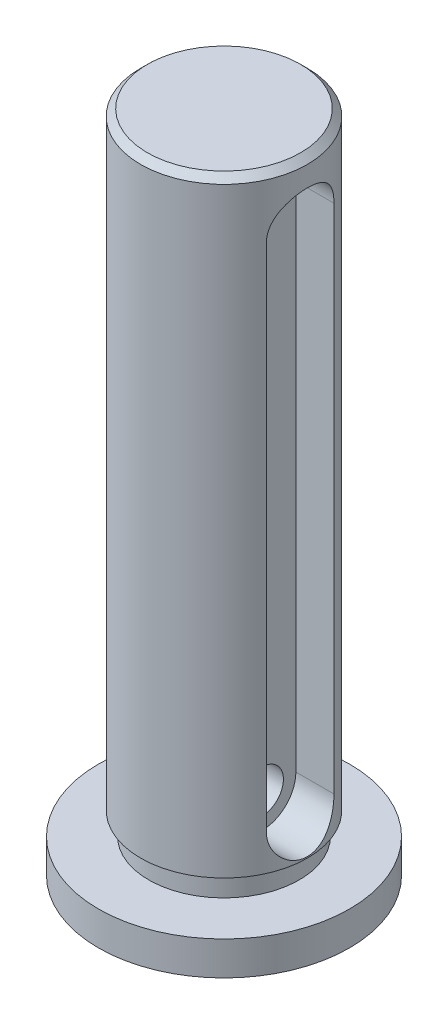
ISO-10303-21;
HEADER;
FILE_DESCRIPTION(('STEP AP214'),'2;1');
FILE_NAME('part.step','',(''),(''),'','','');
FILE_SCHEMA(('AUTOMOTIVE_DESIGN { 1 0 10303 214 1 1 1 1 }'));
ENDSEC;
DATA;
#1=APPLICATION_CONTEXT('core data for automotive mechanical design processes');
#2=APPLICATION_PROTOCOL_DEFINITION('international standard','automotive_design',2000,#1);
#3=PRODUCT_CONTEXT('',#1,'mechanical');
#4=PRODUCT('Part','Part','',(#3));
#5=PRODUCT_RELATED_PRODUCT_CATEGORY('part','',(#4));
#6=PRODUCT_DEFINITION_FORMATION('','',#4);
#7=PRODUCT_DEFINITION_CONTEXT('part definition',#1,'design');
#8=PRODUCT_DEFINITION('design','',#6,#7);
#9=PRODUCT_DEFINITION_SHAPE('','',#8);
#10=(LENGTH_UNIT() NAMED_UNIT(*) SI_UNIT(.MILLI.,.METRE.));
#11=(NAMED_UNIT(*) PLANE_ANGLE_UNIT() SI_UNIT($,.RADIAN.));
#12=(NAMED_UNIT(*) SI_UNIT($,.STERADIAN.) SOLID_ANGLE_UNIT());
#13=UNCERTAINTY_MEASURE_WITH_UNIT(LENGTH_MEASURE(1.E-05),#10,'distance_accuracy_value','');
#14=(GEOMETRIC_REPRESENTATION_CONTEXT(3) GLOBAL_UNCERTAINTY_ASSIGNED_CONTEXT((#13)) GLOBAL_UNIT_ASSIGNED_CONTEXT((#10,
#11,#12)) REPRESENTATION_CONTEXT('',''));
#15=CARTESIAN_POINT('',(0.,0.,0.));
#16=DIRECTION('',(0.,0.,1.));
#17=DIRECTION('',(1.,0.,0.));
#18=AXIS2_PLACEMENT_3D('',#15,#16,#17);
#19=CARTESIAN_POINT('',(0.,12.9032,0.));
#20=DIRECTION('',(0.,1.,0.));
#21=DIRECTION('',(-1.,0.,0.));
#22=AXIS2_PLACEMENT_3D('',#19,#20,#21);
#23=CYLINDRICAL_SURFACE('',#22,3.1369);
#24=CARTESIAN_POINT('',(0.,25.5524,0.));
#25=DIRECTION('',(0.,-1.,0.));
#26=DIRECTION('',(1.,0.,0.));
#27=AXIS2_PLACEMENT_3D('',#24,#25,#26);
#28=CIRCLE('',#27,3.1369);
#29=CARTESIAN_POINT('',(3.1369,25.5524,0.));
#30=VERTEX_POINT('',#29);
#31=EDGE_CURVE('E11',#30,#30,#28,.T.);
#32=ORIENTED_EDGE('',*,*,#31,.T.);
#33=EDGE_LOOP('',(#32));
#34=FACE_BOUND('',#33,.T.);
#35=CARTESIAN_POINT('',(0.,2.9464,0.));
#36=DIRECTION('',(0.,1.,0.));
#37=DIRECTION('',(-1.,0.,0.));
#38=AXIS2_PLACEMENT_3D('',#35,#36,#37);
#39=CIRCLE('',#38,3.1369);
#40=CARTESIAN_POINT('',(-3.1369,2.9464,0.));
#41=VERTEX_POINT('',#40);
#42=EDGE_CURVE('E82',#41,#41,#39,.T.);
#43=ORIENTED_EDGE('',*,*,#42,.T.);
#44=EDGE_LOOP('',(#43));
#45=FACE_BOUND('',#44,.T.);
#46=CARTESIAN_POINT('',(2.86831686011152,23.5204,-1.27));
#47=CARTESIAN_POINT('',(2.86831228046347,23.5545372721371,-1.2700015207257));
#48=CARTESIAN_POINT('',(2.86892705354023,23.5886564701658,-1.26862270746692));
#49=CARTESIAN_POINT('',(2.87134964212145,23.6566187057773,-1.26313358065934));
#50=CARTESIAN_POINT('',(2.87315699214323,23.6904618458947,-1.25902433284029));
#51=CARTESIAN_POINT('',(2.88027699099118,23.790929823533,-1.24269627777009));
#52=CARTESIAN_POINT('',(2.88728848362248,23.8568304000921,-1.22647648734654));
#53=CARTESIAN_POINT('',(2.90495322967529,23.9846552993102,-1.1840218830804));
#54=CARTESIAN_POINT('',(2.91560254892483,24.0465838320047,-1.15779788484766));
#55=CARTESIAN_POINT('',(2.93933152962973,24.1652356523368,-1.09615716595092));
#56=CARTESIAN_POINT('',(2.95241356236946,24.2219537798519,-1.06073146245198));
#57=CARTESIAN_POINT('',(2.98037578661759,24.3318005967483,-0.979509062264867));
#58=CARTESIAN_POINT('',(2.99531437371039,24.3845833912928,-0.933264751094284));
#59=CARTESIAN_POINT('',(3.02482364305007,24.4818932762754,-0.832664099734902));
#60=CARTESIAN_POINT('',(3.03939424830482,24.5264186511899,-0.778306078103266));
#61=CARTESIAN_POINT('',(3.06723971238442,24.6077075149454,-0.660302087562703));
#62=CARTESIAN_POINT('',(3.08043785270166,24.644082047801,-0.596368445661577));
#63=CARTESIAN_POINT('',(3.10333328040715,24.7054100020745,-0.462659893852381));
#64=CARTESIAN_POINT('',(3.11303206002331,24.7303682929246,-0.392887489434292));
#65=CARTESIAN_POINT('',(3.12741857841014,24.7669044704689,-0.253142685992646));
#66=CARTESIAN_POINT('',(3.13233046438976,24.7790831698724,-0.183350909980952));
#67=CARTESIAN_POINT('',(3.13740114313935,24.7916512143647,-0.0425517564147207));
#68=CARTESIAN_POINT('',(3.13756166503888,24.7920448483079,0.028455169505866));
#69=CARTESIAN_POINT('',(3.13324642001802,24.7813562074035,0.165317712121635));
#70=CARTESIAN_POINT('',(3.12903679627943,24.7709327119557,0.231234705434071));
#71=CARTESIAN_POINT('',(3.11681505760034,24.7400290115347,0.360289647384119));
#72=CARTESIAN_POINT('',(3.10880272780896,24.7195482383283,0.423427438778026));
#73=CARTESIAN_POINT('',(3.0896034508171,24.6688617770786,0.546277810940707));
#74=CARTESIAN_POINT('',(3.07837026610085,24.6385135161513,0.60592404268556));
#75=CARTESIAN_POINT('',(3.05383948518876,24.5690882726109,0.719432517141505));
#76=CARTESIAN_POINT('',(3.04054115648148,24.5300081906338,0.77329269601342));
#77=CARTESIAN_POINT('',(3.0121738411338,24.441180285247,0.877531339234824));
#78=CARTESIAN_POINT('',(2.99704591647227,24.3908932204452,0.927434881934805));
#79=CARTESIAN_POINT('',(2.96740404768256,24.2826029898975,1.01830484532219));
#80=CARTESIAN_POINT('',(2.95289039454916,24.2245962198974,1.05926706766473));
#81=CARTESIAN_POINT('',(2.92570847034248,24.1003226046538,1.13222635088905));
#82=CARTESIAN_POINT('',(2.91310878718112,24.0338598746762,1.16391690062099));
#83=CARTESIAN_POINT('',(2.89199846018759,23.8959304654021,1.21543096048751));
#84=CARTESIAN_POINT('',(2.883480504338,23.8244729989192,1.23527570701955));
#85=CARTESIAN_POINT('',(2.87456629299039,23.7136344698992,1.25581250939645));
#86=CARTESIAN_POINT('',(2.87223406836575,23.6752113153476,1.26112514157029));
#87=CARTESIAN_POINT('',(2.86910563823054,23.598000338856,1.26821960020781));
#88=CARTESIAN_POINT('',(2.86830859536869,23.5592127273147,1.27000335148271));
#89=CARTESIAN_POINT('',(2.86831686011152,23.5204,1.27));
#90=B_SPLINE_CURVE_WITH_KNOTS('',3,(#46,#47,#48,#49,#50,#51,#52,#53,#54,#55,#56,#57,#58,#59,#60,
#61,#62,#63,#64,#65,#66,#67,#68,#69,#70,#71,#72,#73,#74,#75,#76,#77,#78,#79,#80,#81,#82,#83,#84,
#85,#86,#87,#88,#89),.UNSPECIFIED.,.F.,.F.,(4,2,2,2,2,2,2,2,2,2,2,2,2,2,2,2,2,2,2,2,2,4),(0.,
0.102343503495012,0.204647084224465,0.408256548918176,0.611646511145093,0.815235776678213,
1.02953735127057,1.24388339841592,1.46693998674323,1.68990134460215,1.90183353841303,
2.11368860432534,2.31335799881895,2.51303867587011,2.71574322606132,2.91851984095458,
3.1348799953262,3.35134152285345,3.57430997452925,3.7968774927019,3.91328211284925,
4.02962322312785),.UNSPECIFIED.);
#91=CARTESIAN_POINT('',(2.86831686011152,23.5204,-1.27));
#92=VERTEX_POINT('',#91);
#93=CARTESIAN_POINT('',(2.86831686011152,23.5204,1.27));
#94=VERTEX_POINT('',#93);
#95=EDGE_CURVE('E57',#92,#94,#90,.T.);
#96=ORIENTED_EDGE('',*,*,#95,.F.);
#97=DIRECTION('',(0.,1.,0.));
#98=VECTOR('',#97,1.);
#99=CARTESIAN_POINT('',(2.86831686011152,12.9032,-1.27));
#100=LINE('',#99,#98);
#101=CARTESIAN_POINT('',(2.86831686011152,4.26720000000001,-1.27));
#102=VERTEX_POINT('',#101);
#103=EDGE_CURVE('E123',#102,#92,#100,.T.);
#104=ORIENTED_EDGE('',*,*,#103,.F.);
#105=CARTESIAN_POINT('',(2.86831686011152,4.26720000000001,1.27));
#106=CARTESIAN_POINT('',(2.86831228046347,4.23306272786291,1.27000152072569));
#107=CARTESIAN_POINT('',(2.86892705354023,4.19894352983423,1.26862270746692));
#108=CARTESIAN_POINT('',(2.87134964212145,4.13098129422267,1.26313358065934));
#109=CARTESIAN_POINT('',(2.87315699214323,4.0971381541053,1.25902433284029));
#110=CARTESIAN_POINT('',(2.88027699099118,3.996670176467,1.24269627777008));
#111=CARTESIAN_POINT('',(2.88728848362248,3.93076959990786,1.22647648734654));
#112=CARTESIAN_POINT('',(2.90495322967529,3.80294470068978,1.1840218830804));
#113=CARTESIAN_POINT('',(2.91560254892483,3.74101616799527,1.15779788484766));
#114=CARTESIAN_POINT('',(2.93933152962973,3.6223643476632,1.09615716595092));
#115=CARTESIAN_POINT('',(2.95241356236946,3.56564622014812,1.06073146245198));
#116=CARTESIAN_POINT('',(2.98037578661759,3.4557994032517,0.979509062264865));
#117=CARTESIAN_POINT('',(2.99531437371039,3.40301660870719,0.933264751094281));
#118=CARTESIAN_POINT('',(3.02482364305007,3.30570672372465,0.8326640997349));
#119=CARTESIAN_POINT('',(3.03939424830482,3.26118134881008,0.778306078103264));
#120=CARTESIAN_POINT('',(3.06723971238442,3.17989248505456,0.660302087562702));
#121=CARTESIAN_POINT('',(3.08043785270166,3.14351795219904,0.596368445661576));
#122=CARTESIAN_POINT('',(3.10333328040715,3.08218999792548,0.462659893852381));
#123=CARTESIAN_POINT('',(3.11303206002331,3.05723170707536,0.392887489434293));
#124=CARTESIAN_POINT('',(3.12741857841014,3.02069552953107,0.253142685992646));
#125=CARTESIAN_POINT('',(3.13233046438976,3.00851683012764,0.183350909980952));
#126=CARTESIAN_POINT('',(3.13740114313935,2.99594878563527,0.04255175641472));
#127=CARTESIAN_POINT('',(3.13756166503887,2.99555515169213,-0.0284551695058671));
#128=CARTESIAN_POINT('',(3.13324642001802,3.00624379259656,-0.165317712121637));
#129=CARTESIAN_POINT('',(3.12903679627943,3.01666728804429,-0.231234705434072));
#130=CARTESIAN_POINT('',(3.11681505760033,3.04757098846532,-0.360289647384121));
#131=CARTESIAN_POINT('',(3.10880272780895,3.06805176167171,-0.423427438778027));
#132=CARTESIAN_POINT('',(3.0896034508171,3.11873822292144,-0.546277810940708));
#133=CARTESIAN_POINT('',(3.07837026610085,3.14908648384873,-0.605924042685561));
#134=CARTESIAN_POINT('',(3.05383948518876,3.21851172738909,-0.719432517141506));
#135=CARTESIAN_POINT('',(3.04054115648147,3.25759180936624,-0.773292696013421));
#136=CARTESIAN_POINT('',(3.0121738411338,3.34641971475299,-0.877531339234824));
#137=CARTESIAN_POINT('',(2.99704591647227,3.39670677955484,-0.927434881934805));
#138=CARTESIAN_POINT('',(2.96740404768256,3.50499701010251,-1.01830484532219));
#139=CARTESIAN_POINT('',(2.95289039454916,3.56300378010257,-1.05926706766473));
#140=CARTESIAN_POINT('',(2.92570847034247,3.68727739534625,-1.13222635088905));
#141=CARTESIAN_POINT('',(2.91310878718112,3.75374012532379,-1.16391690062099));
#142=CARTESIAN_POINT('',(2.89199846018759,3.89166953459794,-1.21543096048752));
#143=CARTESIAN_POINT('',(2.883480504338,3.96312700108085,-1.23527570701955));
#144=CARTESIAN_POINT('',(2.87456629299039,4.07396553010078,-1.25581250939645));
#145=CARTESIAN_POINT('',(2.87223406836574,4.11238868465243,-1.2611251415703));
#146=CARTESIAN_POINT('',(2.86910563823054,4.18959966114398,-1.26821960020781));
#147=CARTESIAN_POINT('',(2.86830859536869,4.2283872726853,-1.27000335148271));
#148=CARTESIAN_POINT('',(2.86831686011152,4.26720000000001,-1.27));
#149=B_SPLINE_CURVE_WITH_KNOTS('',3,(#105,#106,#107,#108,#109,#110,#111,#112,#113,#114,#115,
#116,#117,#118,#119,#120,#121,#122,#123,#124,#125,#126,#127,#128,#129,#130,#131,#132,#133,#134,
#135,#136,#137,#138,#139,#140,#141,#142,#143,#144,#145,#146,#147,#148),.UNSPECIFIED.,.F.,.F.,(4,
2,2,2,2,2,2,2,2,2,2,2,2,2,2,2,2,2,2,2,2,4),(0.,0.102343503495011,0.20464708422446,
0.408256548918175,0.611646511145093,0.81523577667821,1.02953735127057,1.24388339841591,
1.46693998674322,1.68990134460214,1.90183353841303,2.11368860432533,2.31335799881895,
2.5130386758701,2.71574322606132,2.91851984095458,3.13487999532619,3.35134152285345,
3.57430997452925,3.7968774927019,3.91328211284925,4.02962322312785),.UNSPECIFIED.);
#150=CARTESIAN_POINT('',(2.86831686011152,4.26720000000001,1.27));
#151=VERTEX_POINT('',#150);
#152=EDGE_CURVE('E125',#151,#102,#149,.T.);
#153=ORIENTED_EDGE('',*,*,#152,.F.);
#154=DIRECTION('',(0.,1.,0.));
#155=VECTOR('',#154,1.);
#156=CARTESIAN_POINT('',(2.86831686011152,12.9032,1.27));
#157=LINE('',#156,#155);
#158=EDGE_CURVE('E133',#94,#151,#157,.F.);
#159=ORIENTED_EDGE('',*,*,#158,.F.);
#160=EDGE_LOOP('',(#96,#104,#153,#159));
#161=FACE_BOUND('',#160,.T.);
#162=ADVANCED_FACE('F34',(#34,#45,#161),#23,.T.);
#163=CARTESIAN_POINT('',(0.,14.1366875,0.));
#164=DIRECTION('',(0.,1.,0.));
#165=DIRECTION('',(1.,0.,0.));
#166=AXIS2_PLACEMENT_3D('',#163,#164,#165);
#167=SPHERICAL_SURFACE('',#166,14.1366875);
#168=CARTESIAN_POINT('',(0.,0.812800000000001,0.));
#169=DIRECTION('',(0.,1.,0.));
#170=DIRECTION('',(-1.,0.,0.));
#171=AXIS2_PLACEMENT_3D('',#168,#169,#170);
#172=CIRCLE('',#171,4.7244);
#173=CARTESIAN_POINT('',(-4.7244,0.812800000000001,0.));
#174=VERTEX_POINT('',#173);
#175=EDGE_CURVE('E120',#174,#174,#172,.T.);
#176=ORIENTED_EDGE('',*,*,#175,.F.);
#177=EDGE_LOOP('',(#176));
#178=FACE_BOUND('',#177,.T.);
#179=ADVANCED_FACE('F170',(#178),#167,.T.);
#180=CARTESIAN_POINT('',(0.,12.9032,0.));
#181=DIRECTION('',(0.,1.,0.));
#182=DIRECTION('',(-1.,0.,0.));
#183=AXIS2_PLACEMENT_3D('',#180,#181,#182);
#184=CYLINDRICAL_SURFACE('',#183,4.7244);
#185=CARTESIAN_POINT('',(0.,2.0828,0.));
#186=DIRECTION('',(0.,1.,0.));
#187=DIRECTION('',(-1.,0.,0.));
#188=AXIS2_PLACEMENT_3D('',#185,#186,#187);
#189=CIRCLE('',#188,4.7244);
#190=CARTESIAN_POINT('',(-4.7244,2.0828,0.));
#191=VERTEX_POINT('',#190);
#192=EDGE_CURVE('E117',#191,#191,#189,.T.);
#193=ORIENTED_EDGE('',*,*,#192,.F.);
#194=EDGE_LOOP('',(#193));
#195=FACE_BOUND('',#194,.T.);
#196=ORIENTED_EDGE('',*,*,#175,.T.);
#197=EDGE_LOOP('',(#196));
#198=FACE_BOUND('',#197,.T.);
#199=ADVANCED_FACE('F175',(#195,#198),#184,.T.);
#200=CARTESIAN_POINT('',(4.7244,2.0828,0.));
#201=DIRECTION('',(0.,-1.,0.));
#202=DIRECTION('',(1.,0.,0.));
#203=AXIS2_PLACEMENT_3D('',#200,#201,#202);
#204=PLANE('',#203);
#205=CARTESIAN_POINT('',(0.,2.0828,0.));
#206=DIRECTION('',(0.,1.,0.));
#207=DIRECTION('',(-1.,0.,0.));
#208=AXIS2_PLACEMENT_3D('',#205,#206,#207);
#209=CIRCLE('',#208,2.8321);
#210=CARTESIAN_POINT('',(-2.8321,2.0828,0.));
#211=VERTEX_POINT('',#210);
#212=EDGE_CURVE('E114',#211,#211,#209,.T.);
#213=ORIENTED_EDGE('',*,*,#212,.F.);
#214=EDGE_LOOP('',(#213));
#215=FACE_BOUND('',#214,.T.);
#216=ORIENTED_EDGE('',*,*,#192,.T.);
#217=EDGE_LOOP('',(#216));
#218=FACE_BOUND('',#217,.T.);
#219=ADVANCED_FACE('F293',(#215,#218),#204,.F.);
#220=CARTESIAN_POINT('',(0.,12.9032,0.));
#221=DIRECTION('',(0.,1.,0.));
#222=DIRECTION('',(-1.,0.,0.));
#223=AXIS2_PLACEMENT_3D('',#220,#221,#222);
#224=CYLINDRICAL_SURFACE('',#223,2.8321);
#225=CARTESIAN_POINT('',(0.,2.9464,0.));
#226=DIRECTION('',(0.,1.,0.));
#227=DIRECTION('',(-1.,0.,0.));
#228=AXIS2_PLACEMENT_3D('',#225,#226,#227);
#229=CIRCLE('',#228,2.8321);
#230=CARTESIAN_POINT('',(-2.8321,2.9464,0.));
#231=VERTEX_POINT('',#230);
#232=EDGE_CURVE('E111',#231,#231,#229,.T.);
#233=ORIENTED_EDGE('',*,*,#232,.F.);
#234=EDGE_LOOP('',(#233));
#235=FACE_BOUND('',#234,.T.);
#236=ORIENTED_EDGE('',*,*,#212,.T.);
#237=EDGE_LOOP('',(#236));
#238=FACE_BOUND('',#237,.T.);
#239=ADVANCED_FACE('F286',(#235,#238),#224,.T.);
#240=CARTESIAN_POINT('',(2.8321,2.9464,0.));
#241=DIRECTION('',(0.,1.,0.));
#242=DIRECTION('',(-1.,0.,0.));
#243=AXIS2_PLACEMENT_3D('',#240,#241,#242);
#244=PLANE('',#243);
#245=ORIENTED_EDGE('',*,*,#42,.F.);
#246=EDGE_LOOP('',(#245));
#247=FACE_BOUND('',#246,.T.);
#248=ORIENTED_EDGE('',*,*,#232,.T.);
#249=EDGE_LOOP('',(#248));
#250=FACE_BOUND('',#249,.T.);
#251=ADVANCED_FACE('F235',(#247,#250),#244,.F.);
#252=CARTESIAN_POINT('',(3.1369,25.8064,0.));
#253=DIRECTION('',(0.,-1.,0.));
#254=DIRECTION('',(1.,0.,0.));
#255=AXIS2_PLACEMENT_3D('',#252,#253,#254);
#256=PLANE('',#255);
#257=CARTESIAN_POINT('',(0.,25.8064,0.));
#258=DIRECTION('',(0.,-1.,0.));
#259=DIRECTION('',(1.,0.,0.));
#260=AXIS2_PLACEMENT_3D('',#257,#258,#259);
#261=CIRCLE('',#260,2.88290000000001);
#262=CARTESIAN_POINT('',(2.88290000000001,25.8064,0.));
#263=VERTEX_POINT('',#262);
#264=EDGE_CURVE('E42',#263,#263,#261,.F.);
#265=ORIENTED_EDGE('',*,*,#264,.T.);
#266=EDGE_LOOP('',(#265));
#267=FACE_BOUND('',#266,.T.);
#268=ADVANCED_FACE('F150',(#267),#256,.F.);
#269=CARTESIAN_POINT('',(3.8481,23.5204,0.));
#270=DIRECTION('',(-1.,0.,0.));
#271=DIRECTION('',(0.,0.,1.));
#272=AXIS2_PLACEMENT_3D('',#269,#270,#271);
#273=CYLINDRICAL_SURFACE('',#272,1.27);
#274=ORIENTED_EDGE('',*,*,#95,.T.);
#275=DIRECTION('',(-1.,0.,0.));
#276=VECTOR('',#275,1.);
#277=CARTESIAN_POINT('',(3.8481,23.5204,1.27));
#278=LINE('',#277,#276);
#279=CARTESIAN_POINT('',(1.4351,23.5204,1.27));
#280=VERTEX_POINT('',#279);
#281=EDGE_CURVE('E74',#94,#280,#278,.T.);
#282=ORIENTED_EDGE('',*,*,#281,.T.);
#283=CARTESIAN_POINT('',(1.4351,23.5204,0.));
#284=DIRECTION('',(1.,0.,0.));
#285=DIRECTION('',(0.,0.,-1.));
#286=AXIS2_PLACEMENT_3D('',#283,#284,#285);
#287=CIRCLE('',#286,1.27);
#288=CARTESIAN_POINT('',(1.4351,23.5204,-1.27));
#289=VERTEX_POINT('',#288);
#290=EDGE_CURVE('E78',#289,#280,#287,.T.);
#291=ORIENTED_EDGE('',*,*,#290,.F.);
#292=DIRECTION('',(-1.,0.,0.));
#293=VECTOR('',#292,1.);
#294=CARTESIAN_POINT('',(3.8481,23.5204,-1.27));
#295=LINE('',#294,#293);
#296=EDGE_CURVE('E105',#92,#289,#295,.T.);
#297=ORIENTED_EDGE('',*,*,#296,.F.);
#298=EDGE_LOOP('',(#274,#282,#291,#297));
#299=FACE_BOUND('',#298,.T.);
#300=ADVANCED_FACE('F76',(#299),#273,.F.);
#301=CARTESIAN_POINT('',(3.8481,23.5204,1.27));
#302=DIRECTION('',(0.,0.,-1.));
#303=DIRECTION('',(0.,1.,0.));
#304=AXIS2_PLACEMENT_3D('',#301,#302,#303);
#305=PLANE('',#304);
#306=ORIENTED_EDGE('',*,*,#158,.T.);
#307=DIRECTION('',(-1.,0.,0.));
#308=VECTOR('',#307,1.);
#309=CARTESIAN_POINT('',(3.8481,4.26720000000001,1.27));
#310=LINE('',#309,#308);
#311=CARTESIAN_POINT('',(1.4351,4.26720000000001,1.27));
#312=VERTEX_POINT('',#311);
#313=EDGE_CURVE('E83',#151,#312,#310,.T.);
#314=ORIENTED_EDGE('',*,*,#313,.T.);
#315=DIRECTION('',(0.,-1.,0.));
#316=VECTOR('',#315,1.);
#317=CARTESIAN_POINT('',(1.4351,23.5204,1.27));
#318=LINE('',#317,#316);
#319=EDGE_CURVE('E86',#280,#312,#318,.T.);
#320=ORIENTED_EDGE('',*,*,#319,.F.);
#321=ORIENTED_EDGE('',*,*,#281,.F.);
#322=EDGE_LOOP('',(#306,#314,#320,#321));
#323=FACE_BOUND('',#322,.T.);
#324=ADVANCED_FACE('F87',(#323),#305,.T.);
#325=CARTESIAN_POINT('',(3.8481,4.26720000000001,0.));
#326=DIRECTION('',(-1.,0.,0.));
#327=DIRECTION('',(0.,0.,1.));
#328=AXIS2_PLACEMENT_3D('',#325,#326,#327);
#329=CYLINDRICAL_SURFACE('',#328,1.27);
#330=ORIENTED_EDGE('',*,*,#152,.T.);
#331=DIRECTION('',(-1.,0.,0.));
#332=VECTOR('',#331,1.);
#333=CARTESIAN_POINT('',(3.8481,4.26720000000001,-1.27));
#334=LINE('',#333,#332);
#335=CARTESIAN_POINT('',(1.4351,4.26720000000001,-1.27));
#336=VERTEX_POINT('',#335);
#337=EDGE_CURVE('E49',#102,#336,#334,.T.);
#338=ORIENTED_EDGE('',*,*,#337,.T.);
#339=CARTESIAN_POINT('',(1.4351,4.26720000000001,0.));
#340=DIRECTION('',(1.,0.,0.));
#341=DIRECTION('',(0.,0.,-1.));
#342=AXIS2_PLACEMENT_3D('',#339,#340,#341);
#343=CIRCLE('',#342,1.27);
#344=EDGE_CURVE('E92',#312,#336,#343,.T.);
#345=ORIENTED_EDGE('',*,*,#344,.F.);
#346=ORIENTED_EDGE('',*,*,#313,.F.);
#347=EDGE_LOOP('',(#330,#338,#345,#346));
#348=FACE_BOUND('',#347,.T.);
#349=ADVANCED_FACE('F138',(#348),#329,.F.);
#350=CARTESIAN_POINT('',(3.8481,23.5204,-1.27));
#351=DIRECTION('',(0.,0.,1.));
#352=DIRECTION('',(0.,-1.,0.));
#353=AXIS2_PLACEMENT_3D('',#350,#351,#352);
#354=PLANE('',#353);
#355=ORIENTED_EDGE('',*,*,#103,.T.);
#356=ORIENTED_EDGE('',*,*,#296,.T.);
#357=DIRECTION('',(0.,1.,0.));
#358=VECTOR('',#357,1.);
#359=CARTESIAN_POINT('',(1.4351,23.5204,-1.27));
#360=LINE('',#359,#358);
#361=EDGE_CURVE('E95',#336,#289,#360,.T.);
#362=ORIENTED_EDGE('',*,*,#361,.F.);
#363=ORIENTED_EDGE('',*,*,#337,.F.);
#364=EDGE_LOOP('',(#355,#356,#362,#363));
#365=FACE_BOUND('',#364,.T.);
#366=ADVANCED_FACE('F143',(#365),#354,.T.);
#367=CARTESIAN_POINT('',(1.4351,23.5204,0.));
#368=DIRECTION('',(1.,0.,0.));
#369=DIRECTION('',(0.,0.,-1.));
#370=AXIS2_PLACEMENT_3D('',#367,#368,#369);
#371=PLANE('',#370);
#372=CARTESIAN_POINT('',(1.4351,4.26720000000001,0.));
#373=DIRECTION('',(1.,0.,0.));
#374=DIRECTION('',(0.,1.,0.));
#375=AXIS2_PLACEMENT_3D('',#372,#373,#374);
#376=CIRCLE('',#375,0.8001);
#377=CARTESIAN_POINT('',(1.4351,5.06730000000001,0.));
#378=VERTEX_POINT('',#377);
#379=EDGE_CURVE('E209',#378,#378,#376,.T.);
#380=ORIENTED_EDGE('',*,*,#379,.F.);
#381=EDGE_LOOP('',(#380));
#382=FACE_BOUND('',#381,.T.);
#383=CARTESIAN_POINT('',(1.4351,23.5204,0.));
#384=DIRECTION('',(1.,0.,0.));
#385=DIRECTION('',(0.,1.,0.));
#386=AXIS2_PLACEMENT_3D('',#383,#384,#385);
#387=CIRCLE('',#386,0.800099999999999);
#388=CARTESIAN_POINT('',(1.4351,24.3205,0.));
#389=VERTEX_POINT('',#388);
#390=EDGE_CURVE('E99',#389,#389,#387,.T.);
#391=ORIENTED_EDGE('',*,*,#390,.F.);
#392=EDGE_LOOP('',(#391));
#393=FACE_BOUND('',#392,.T.);
#394=ORIENTED_EDGE('',*,*,#290,.T.);
#395=ORIENTED_EDGE('',*,*,#319,.T.);
#396=ORIENTED_EDGE('',*,*,#344,.T.);
#397=ORIENTED_EDGE('',*,*,#361,.T.);
#398=EDGE_LOOP('',(#394,#395,#396,#397));
#399=FACE_BOUND('',#398,.T.);
#400=ADVANCED_FACE('F94',(#382,#393,#399),#371,.T.);
#401=CARTESIAN_POINT('',(0.317499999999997,23.5204,0.));
#402=DIRECTION('',(1.,0.,0.));
#403=DIRECTION('',(0.,1.,0.));
#404=AXIS2_PLACEMENT_3D('',#401,#402,#403);
#405=CYLINDRICAL_SURFACE('',#404,0.800099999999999);
#406=CARTESIAN_POINT('',(0.317499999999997,23.5204,0.));
#407=DIRECTION('',(1.,0.,0.));
#408=DIRECTION('',(0.,1.,0.));
#409=AXIS2_PLACEMENT_3D('',#406,#407,#408);
#410=CIRCLE('',#409,0.800099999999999);
#411=CARTESIAN_POINT('',(0.317499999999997,24.3205,0.));
#412=VERTEX_POINT('',#411);
#413=EDGE_CURVE('E96',#412,#412,#410,.T.);
#414=ORIENTED_EDGE('',*,*,#413,.F.);
#415=EDGE_LOOP('',(#414));
#416=FACE_BOUND('',#415,.T.);
#417=ORIENTED_EDGE('',*,*,#390,.T.);
#418=EDGE_LOOP('',(#417));
#419=FACE_BOUND('',#418,.T.);
#420=ADVANCED_FACE('F186',(#416,#419),#405,.F.);
#421=CARTESIAN_POINT('',(0.317499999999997,23.5204,0.));
#422=DIRECTION('',(1.,0.,0.));
#423=DIRECTION('',(0.,1.,0.));
#424=AXIS2_PLACEMENT_3D('',#421,#422,#423);
#425=PLANE('',#424);
#426=ORIENTED_EDGE('',*,*,#413,.T.);
#427=EDGE_LOOP('',(#426));
#428=FACE_BOUND('',#427,.T.);
#429=ADVANCED_FACE('F191',(#428),#425,.T.);
#430=CARTESIAN_POINT('',(0.3175,4.26720000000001,0.));
#431=DIRECTION('',(1.,0.,0.));
#432=DIRECTION('',(0.,1.,0.));
#433=AXIS2_PLACEMENT_3D('',#430,#431,#432);
#434=CYLINDRICAL_SURFACE('',#433,0.8001);
#435=CARTESIAN_POINT('',(0.3175,4.26720000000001,0.));
#436=DIRECTION('',(1.,0.,0.));
#437=DIRECTION('',(0.,1.,0.));
#438=AXIS2_PLACEMENT_3D('',#435,#436,#437);
#439=CIRCLE('',#438,0.8001);
#440=CARTESIAN_POINT('',(0.3175,5.06730000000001,0.));
#441=VERTEX_POINT('',#440);
#442=EDGE_CURVE('E207',#441,#441,#439,.T.);
#443=ORIENTED_EDGE('',*,*,#442,.F.);
#444=EDGE_LOOP('',(#443));
#445=FACE_BOUND('',#444,.T.);
#446=ORIENTED_EDGE('',*,*,#379,.T.);
#447=EDGE_LOOP('',(#446));
#448=FACE_BOUND('',#447,.T.);
#449=ADVANCED_FACE('F165',(#445,#448),#434,.F.);
#450=CARTESIAN_POINT('',(0.3175,4.26720000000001,0.));
#451=DIRECTION('',(1.,0.,0.));
#452=DIRECTION('',(0.,1.,0.));
#453=AXIS2_PLACEMENT_3D('',#450,#451,#452);
#454=PLANE('',#453);
#455=ORIENTED_EDGE('',*,*,#442,.T.);
#456=EDGE_LOOP('',(#455));
#457=FACE_BOUND('',#456,.T.);
#458=ADVANCED_FACE('F160',(#457),#454,.T.);
#459=CARTESIAN_POINT('',(0.,25.8064,0.));
#460=DIRECTION('',(0.,-1.,0.));
#461=DIRECTION('',(1.,0.,0.));
#462=AXIS2_PLACEMENT_3D('',#459,#460,#461);
#463=CONICAL_SURFACE('',#462,2.88290000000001,0.78539816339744);
#464=ORIENTED_EDGE('',*,*,#31,.F.);
#465=EDGE_LOOP('',(#464));
#466=FACE_BOUND('',#465,.T.);
#467=ORIENTED_EDGE('',*,*,#264,.F.);
#468=EDGE_LOOP('',(#467));
#469=FACE_BOUND('',#468,.T.);
#470=ADVANCED_FACE('F36',(#466,#469),#463,.T.);
#471=CLOSED_SHELL('',(#162,#179,#199,#219,#239,#251,#268,#300,#324,#349,#366,#400,#420,#429,
#449,#458,#470));
#472=MANIFOLD_SOLID_BREP('B2',#471);
#473=ADVANCED_BREP_SHAPE_REPRESENTATION('',(#18,#472),#14);
#474=SHAPE_DEFINITION_REPRESENTATION(#9,#473);
ENDSEC;
END-ISO-10303-21;
